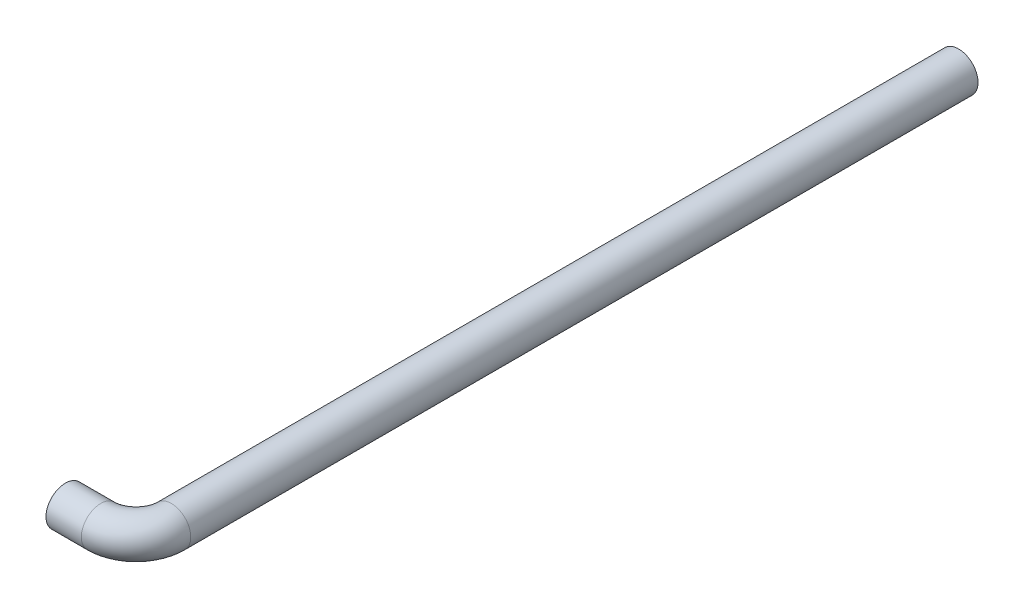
from build123d import *

# Parameters (mm, degrees)
SKETCH1_R = 1.65


with BuildPart() as part:
    # Sweep1: sweep along a path in Sketch2
    with BuildLine(Plane(origin=(0, 0, 0), x_dir=(1, 0, 0), z_dir=(0, 1, 0))) as sweep1_path:
        Line((0, 0), (3, 0))
        ThreePointArc((3, 0), (5.121320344, 0.878679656), (6, 3))
        Line((6, 3), (6, 69.9))
    # Sketch1 → Sweep1 (sweep)
    with BuildSketch(Plane(origin=(0, 0, 0), x_dir=(0, 0, -1), z_dir=(1, 0, 0))):
        Circle(SKETCH1_R)
    sweep(path=sweep1_path.line)


solid = part.part
